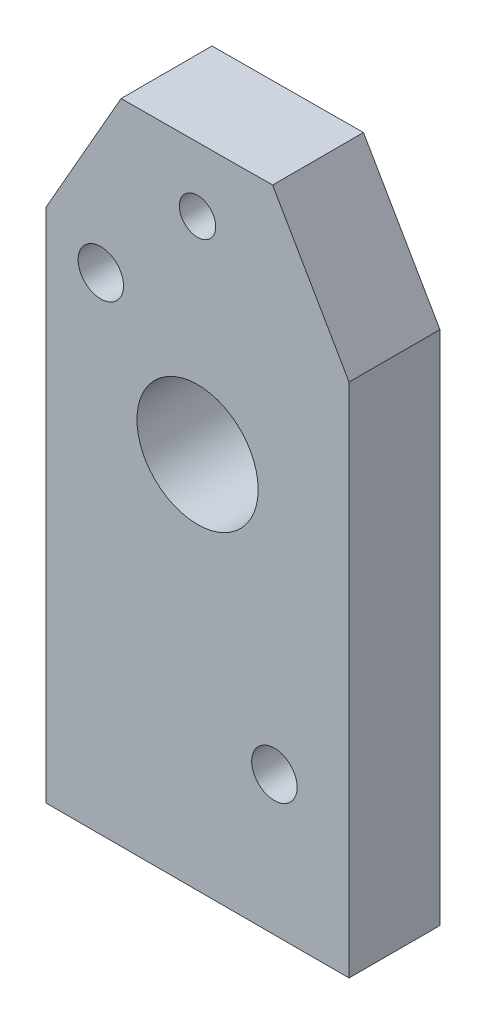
from build123d import *

# Parameters (mm, degrees)
SKETCH1_R           = 1.5
SKETCH1_R_2         = 4
BOSS_EXTRUDE1_DEPTH = 6
SKETCH2_R           = 1.2
CUT_EXTRUDE1_DEPTH  = 6


with BuildPart() as part:
    # Sketch1 → Boss-Extrude1 (new body)
    with BuildSketch(Plane.XY):
        Polygon((16.266052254, 76.06735006), (11.219514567, 84.808209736), (1.219514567, 84.754472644), (-3.733947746, 76.06735006), (-3.733947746, 42.002368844), (16.266052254, 42.002368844), align=None)
        with Locations((11.339921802, 51.182044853)):
            Circle(SKETCH1_R, mode=Mode.SUBTRACT)
        with Locations((-0.120078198, 74.121087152)):
            Circle(SKETCH1_R, mode=Mode.SUBTRACT)
        with Locations((6.266052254, 66.92605899)):
            Circle(SKETCH1_R_2, mode=Mode.SUBTRACT)
    extrude(amount=BOSS_EXTRUDE1_DEPTH)

    # Sketch2 → Cut-Extrude1 (cut)
    with BuildSketch(Plane.XY.offset(6)):
        with Locations((6.266052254, 80.5423747)):
            Circle(SKETCH2_R)
    extrude(amount=-CUT_EXTRUDE1_DEPTH, mode=Mode.SUBTRACT)


solid = part.part
